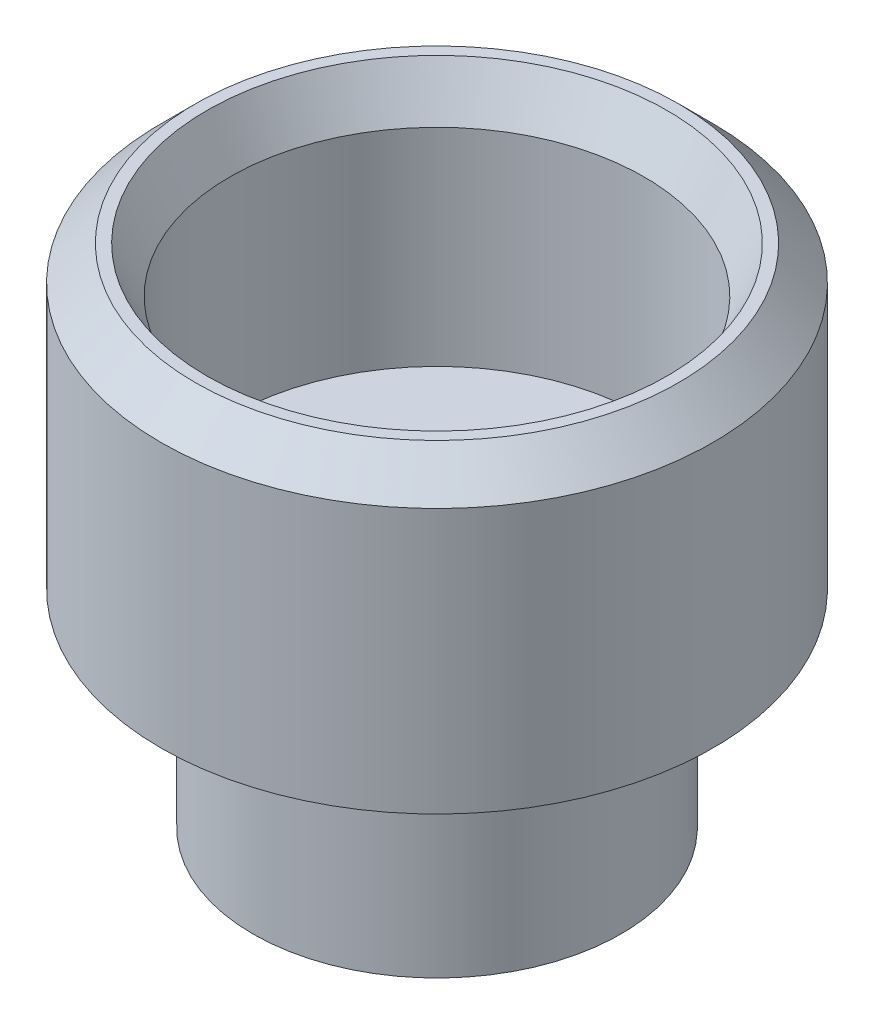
ISO-10303-21;
HEADER;
FILE_DESCRIPTION(('STEP AP214'),'2;1');
FILE_NAME('part.step','',(''),(''),'','','');
FILE_SCHEMA(('AUTOMOTIVE_DESIGN { 1 0 10303 214 1 1 1 1 }'));
ENDSEC;
DATA;
#1=APPLICATION_CONTEXT('core data for automotive mechanical design processes');
#2=APPLICATION_PROTOCOL_DEFINITION('international standard','automotive_design',2000,#1);
#3=PRODUCT_CONTEXT('',#1,'mechanical');
#4=PRODUCT('Part','Part','',(#3));
#5=PRODUCT_RELATED_PRODUCT_CATEGORY('part','',(#4));
#6=PRODUCT_DEFINITION_FORMATION('','',#4);
#7=PRODUCT_DEFINITION_CONTEXT('part definition',#1,'design');
#8=PRODUCT_DEFINITION('design','',#6,#7);
#9=PRODUCT_DEFINITION_SHAPE('','',#8);
#10=(LENGTH_UNIT() NAMED_UNIT(*) SI_UNIT(.MILLI.,.METRE.));
#11=(NAMED_UNIT(*) PLANE_ANGLE_UNIT() SI_UNIT($,.RADIAN.));
#12=(NAMED_UNIT(*) SI_UNIT($,.STERADIAN.) SOLID_ANGLE_UNIT());
#13=UNCERTAINTY_MEASURE_WITH_UNIT(LENGTH_MEASURE(1.E-05),#10,'distance_accuracy_value','');
#14=(GEOMETRIC_REPRESENTATION_CONTEXT(3) GLOBAL_UNCERTAINTY_ASSIGNED_CONTEXT((#13)) GLOBAL_UNIT_ASSIGNED_CONTEXT((#10,
#11,#12)) REPRESENTATION_CONTEXT('',''));
#15=CARTESIAN_POINT('',(0.,0.,0.));
#16=DIRECTION('',(0.,0.,1.));
#17=DIRECTION('',(1.,0.,0.));
#18=AXIS2_PLACEMENT_3D('',#15,#16,#17);
#19=CARTESIAN_POINT('',(0.,9.,0.));
#20=DIRECTION('',(0.,-1.,0.));
#21=DIRECTION('',(0.,0.,-1.));
#22=AXIS2_PLACEMENT_3D('',#19,#20,#21);
#23=CYLINDRICAL_SURFACE('',#22,8.);
#24=CARTESIAN_POINT('',(0.,6.5,0.));
#25=DIRECTION('',(0.,1.,0.));
#26=DIRECTION('',(0.,0.,1.));
#27=AXIS2_PLACEMENT_3D('',#24,#25,#26);
#28=CIRCLE('',#27,8.);
#29=CARTESIAN_POINT('',(0.,6.5,8.));
#30=VERTEX_POINT('',#29);
#31=EDGE_CURVE('E55',#30,#30,#28,.F.);
#32=ORIENTED_EDGE('',*,*,#31,.T.);
#33=EDGE_LOOP('',(#32));
#34=FACE_BOUND('',#33,.T.);
#35=CARTESIAN_POINT('',(0.,0.,0.));
#36=DIRECTION('',(0.,1.,0.));
#37=DIRECTION('',(0.,0.,1.));
#38=AXIS2_PLACEMENT_3D('',#35,#36,#37);
#39=CIRCLE('',#38,8.);
#40=CARTESIAN_POINT('',(0.,0.,8.));
#41=VERTEX_POINT('',#40);
#42=EDGE_CURVE('E58',#41,#41,#39,.T.);
#43=ORIENTED_EDGE('',*,*,#42,.T.);
#44=EDGE_LOOP('',(#43));
#45=FACE_BOUND('',#44,.T.);
#46=ADVANCED_FACE('F35',(#34,#45),#23,.T.);
#47=CARTESIAN_POINT('',(0.,0.,0.));
#48=DIRECTION('',(0.,1.,0.));
#49=DIRECTION('',(0.,0.,1.));
#50=AXIS2_PLACEMENT_3D('',#47,#48,#49);
#51=PLANE('',#50);
#52=CARTESIAN_POINT('',(0.,0.,0.));
#53=DIRECTION('',(0.,-1.,0.));
#54=DIRECTION('',(0.,0.,-1.));
#55=AXIS2_PLACEMENT_3D('',#52,#53,#54);
#56=CIRCLE('',#55,3.5);
#57=CARTESIAN_POINT('',(0.,0.,-3.5));
#58=VERTEX_POINT('',#57);
#59=EDGE_CURVE('E64',#58,#58,#56,.T.);
#60=ORIENTED_EDGE('',*,*,#59,.F.);
#61=EDGE_LOOP('',(#60));
#62=FACE_BOUND('',#61,.T.);
#63=ORIENTED_EDGE('',*,*,#42,.F.);
#64=EDGE_LOOP('',(#63));
#65=FACE_BOUND('',#64,.T.);
#66=ADVANCED_FACE('F89',(#62,#65),#51,.F.);
#67=CARTESIAN_POINT('',(0.,22.,0.));
#68=DIRECTION('',(0.,-1.,0.));
#69=DIRECTION('',(0.,0.,-1.));
#70=AXIS2_PLACEMENT_3D('',#67,#68,#69);
#71=CYLINDRICAL_SURFACE('',#70,12.);
#72=CARTESIAN_POINT('',(0.,20.5,0.));
#73=DIRECTION('',(0.,1.,0.));
#74=DIRECTION('',(0.,0.,1.));
#75=AXIS2_PLACEMENT_3D('',#72,#73,#74);
#76=CIRCLE('',#75,12.);
#77=CARTESIAN_POINT('',(0.,20.5,-12.));
#78=VERTEX_POINT('',#77);
#79=EDGE_CURVE('E46',#78,#78,#76,.F.);
#80=CARTESIAN_POINT('',(0.,9.,0.));
#81=DIRECTION('',(0.,1.,0.));
#82=DIRECTION('',(0.,0.,1.));
#83=AXIS2_PLACEMENT_3D('',#80,#81,#82);
#84=CIRCLE('',#83,12.);
#85=CARTESIAN_POINT('',(0.,9.,-12.));
#86=VERTEX_POINT('',#85);
#87=EDGE_CURVE('E61',#86,#86,#84,.T.);
#88=CARTESIAN_POINT('',(0.,20.5,-12.));
#89=CARTESIAN_POINT('',(0.,20.3802083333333,-12.));
#90=CARTESIAN_POINT('',(0.,20.2604166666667,-12.));
#91=CARTESIAN_POINT('',(0.,20.0208333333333,-12.));
#92=CARTESIAN_POINT('',(0.,19.9010416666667,-12.));
#93=CARTESIAN_POINT('',(0.,19.6614583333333,-12.));
#94=CARTESIAN_POINT('',(0.,19.5416666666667,-12.));
#95=CARTESIAN_POINT('',(0.,19.3020833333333,-12.));
#96=CARTESIAN_POINT('',(0.,19.1822916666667,-12.));
#97=CARTESIAN_POINT('',(0.,18.9427083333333,-12.));
#98=CARTESIAN_POINT('',(0.,18.8229166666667,-12.));
#99=CARTESIAN_POINT('',(0.,18.5833333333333,-12.));
#100=CARTESIAN_POINT('',(0.,18.4635416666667,-12.));
#101=CARTESIAN_POINT('',(0.,18.2239583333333,-12.));
#102=CARTESIAN_POINT('',(0.,18.1041666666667,-12.));
#103=CARTESIAN_POINT('',(0.,17.8645833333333,-12.));
#104=CARTESIAN_POINT('',(0.,17.7447916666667,-12.));
#105=CARTESIAN_POINT('',(0.,17.5052083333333,-12.));
#106=CARTESIAN_POINT('',(0.,17.3854166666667,-12.));
#107=CARTESIAN_POINT('',(0.,17.1458333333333,-12.));
#108=CARTESIAN_POINT('',(0.,17.0260416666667,-12.));
#109=CARTESIAN_POINT('',(0.,16.7864583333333,-12.));
#110=CARTESIAN_POINT('',(0.,16.6666666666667,-12.));
#111=CARTESIAN_POINT('',(0.,16.4270833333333,-12.));
#112=CARTESIAN_POINT('',(0.,16.3072916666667,-12.));
#113=CARTESIAN_POINT('',(0.,16.0677083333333,-12.));
#114=CARTESIAN_POINT('',(0.,15.9479166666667,-12.));
#115=CARTESIAN_POINT('',(0.,15.7083333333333,-12.));
#116=CARTESIAN_POINT('',(0.,15.5885416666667,-12.));
#117=CARTESIAN_POINT('',(0.,15.3489583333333,-12.));
#118=CARTESIAN_POINT('',(0.,15.2291666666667,-12.));
#119=CARTESIAN_POINT('',(0.,14.9895833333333,-12.));
#120=CARTESIAN_POINT('',(0.,14.8697916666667,-12.));
#121=CARTESIAN_POINT('',(0.,14.6302083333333,-12.));
#122=CARTESIAN_POINT('',(0.,14.5104166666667,-12.));
#123=CARTESIAN_POINT('',(0.,14.2708333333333,-12.));
#124=CARTESIAN_POINT('',(0.,14.1510416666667,-12.));
#125=CARTESIAN_POINT('',(0.,13.9114583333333,-12.));
#126=CARTESIAN_POINT('',(0.,13.7916666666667,-12.));
#127=CARTESIAN_POINT('',(0.,13.5520833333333,-12.));
#128=CARTESIAN_POINT('',(0.,13.4322916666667,-12.));
#129=CARTESIAN_POINT('',(0.,13.1927083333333,-12.));
#130=CARTESIAN_POINT('',(0.,13.0729166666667,-12.));
#131=CARTESIAN_POINT('',(0.,12.8333333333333,-12.));
#132=CARTESIAN_POINT('',(0.,12.7135416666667,-12.));
#133=CARTESIAN_POINT('',(0.,12.4739583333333,-12.));
#134=CARTESIAN_POINT('',(0.,12.3541666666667,-12.));
#135=CARTESIAN_POINT('',(0.,12.1145833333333,-12.));
#136=CARTESIAN_POINT('',(0.,11.9947916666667,-12.));
#137=CARTESIAN_POINT('',(0.,11.7552083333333,-12.));
#138=CARTESIAN_POINT('',(0.,11.6354166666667,-12.));
#139=CARTESIAN_POINT('',(0.,11.3958333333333,-12.));
#140=CARTESIAN_POINT('',(0.,11.2760416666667,-12.));
#141=CARTESIAN_POINT('',(0.,11.0364583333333,-12.));
#142=CARTESIAN_POINT('',(0.,10.9166666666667,-12.));
#143=CARTESIAN_POINT('',(0.,10.6770833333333,-12.));
#144=CARTESIAN_POINT('',(0.,10.5572916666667,-12.));
#145=CARTESIAN_POINT('',(0.,10.3177083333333,-12.));
#146=CARTESIAN_POINT('',(0.,10.1979166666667,-12.));
#147=CARTESIAN_POINT('',(0.,9.95833333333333,-12.));
#148=CARTESIAN_POINT('',(0.,9.83854166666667,-12.));
#149=CARTESIAN_POINT('',(0.,9.59895833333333,-12.));
#150=CARTESIAN_POINT('',(0.,9.47916666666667,-12.));
#151=CARTESIAN_POINT('',(0.,9.23958333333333,-12.));
#152=CARTESIAN_POINT('',(0.,9.11979166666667,-12.));
#153=CARTESIAN_POINT('',(0.,9.,-12.));
#154=B_SPLINE_CURVE_WITH_KNOTS('',3,(#88,#89,#90,#91,#92,#93,#94,#95,#96,#97,#98,#99,#100,#101,
#102,#103,#104,#105,#106,#107,#108,#109,#110,#111,#112,#113,#114,#115,#116,#117,#118,#119,#120,
#121,#122,#123,#124,#125,#126,#127,#128,#129,#130,#131,#132,#133,#134,#135,#136,#137,#138,#139,
#140,#141,#142,#143,#144,#145,#146,#147,#148,#149,#150,#151,#152,#153),.UNSPECIFIED.,.F.,.F.,(4,
2,2,2,2,2,2,2,2,2,2,2,2,2,2,2,2,2,2,2,2,2,2,2,2,2,2,2,2,2,2,2,4),(0.,0.359375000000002,
0.718750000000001,1.078125,1.4375,1.796875,2.15625,2.515625,2.875,3.234375,3.59375,
3.95312500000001,4.3125,4.671875,5.03125,5.390625,5.75000000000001,6.10937500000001,6.46875,
6.82812500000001,7.1875,7.54687500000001,7.90625000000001,8.26562500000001,8.62500000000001,
8.98437500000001,9.34375000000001,9.70312500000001,10.0625,10.421875,10.78125,11.140625,11.5),.UNSPECIFIED.);
#155=EDGE_CURVE('BSEAM95',#78,#86,#154,.T.);
#156=ORIENTED_EDGE('',*,*,#79,.T.);
#157=ORIENTED_EDGE('',*,*,#87,.T.);
#158=ORIENTED_EDGE('',*,*,#155,.T.);
#159=ORIENTED_EDGE('',*,*,#155,.F.);
#160=EDGE_LOOP('',(#156,#158,#157,#159));
#161=FACE_BOUND('',#160,.T.);
#162=ADVANCED_FACE('F95',(#161),#71,.T.);
#163=CARTESIAN_POINT('',(0.,22.,0.));
#164=DIRECTION('',(0.,1.,0.));
#165=DIRECTION('',(0.,0.,1.));
#166=AXIS2_PLACEMENT_3D('',#163,#164,#165);
#167=PLANE('',#166);
#168=CARTESIAN_POINT('',(0.,22.,0.));
#169=DIRECTION('',(0.,1.,0.));
#170=DIRECTION('',(0.,0.,1.));
#171=AXIS2_PLACEMENT_3D('',#168,#169,#170);
#172=CIRCLE('',#171,9.99999999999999);
#173=CARTESIAN_POINT('',(0.,22.,9.99999999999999));
#174=VERTEX_POINT('',#173);
#175=EDGE_CURVE('E10',#174,#174,#172,.F.);
#176=ORIENTED_EDGE('',*,*,#175,.T.);
#177=EDGE_LOOP('',(#176));
#178=FACE_BOUND('',#177,.T.);
#179=CARTESIAN_POINT('',(0.,22.,0.));
#180=DIRECTION('',(0.,1.,0.));
#181=DIRECTION('',(0.,0.,1.));
#182=AXIS2_PLACEMENT_3D('',#179,#180,#181);
#183=CIRCLE('',#182,10.5);
#184=CARTESIAN_POINT('',(0.,22.,10.5));
#185=VERTEX_POINT('',#184);
#186=EDGE_CURVE('E50',#185,#185,#183,.T.);
#187=ORIENTED_EDGE('',*,*,#186,.T.);
#188=EDGE_LOOP('',(#187));
#189=FACE_BOUND('',#188,.T.);
#190=ADVANCED_FACE('F104',(#178,#189),#167,.T.);
#191=CARTESIAN_POINT('',(0.,9.,0.));
#192=DIRECTION('',(0.,1.,0.));
#193=DIRECTION('',(0.,0.,1.));
#194=AXIS2_PLACEMENT_3D('',#191,#192,#193);
#195=CONICAL_SURFACE('',#194,12.,1.01219701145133);
#196=ORIENTED_EDGE('',*,*,#31,.F.);
#197=EDGE_LOOP('',(#196));
#198=FACE_BOUND('',#197,.T.);
#199=ORIENTED_EDGE('',*,*,#87,.F.);
#200=EDGE_LOOP('',(#199));
#201=FACE_BOUND('',#200,.T.);
#202=ADVANCED_FACE('F101',(#198,#201),#195,.T.);
#203=CARTESIAN_POINT('',(0.,22.,0.));
#204=DIRECTION('',(0.,-1.,0.));
#205=DIRECTION('',(0.,0.,-1.));
#206=AXIS2_PLACEMENT_3D('',#203,#204,#205);
#207=CONICAL_SURFACE('',#206,10.5,0.785398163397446);
#208=ORIENTED_EDGE('',*,*,#79,.F.);
#209=EDGE_LOOP('',(#208));
#210=FACE_BOUND('',#209,.T.);
#211=ORIENTED_EDGE('',*,*,#186,.F.);
#212=EDGE_LOOP('',(#211));
#213=FACE_BOUND('',#212,.T.);
#214=ADVANCED_FACE('F103',(#210,#213),#207,.T.);
#215=CARTESIAN_POINT('',(0.,11.,0.));
#216=DIRECTION('',(0.,-1.,0.));
#217=DIRECTION('',(0.,0.,-1.));
#218=AXIS2_PLACEMENT_3D('',#215,#216,#217);
#219=CYLINDRICAL_SURFACE('',#218,3.5);
#220=CARTESIAN_POINT('',(0.,11.,0.));
#221=DIRECTION('',(0.,1.,0.));
#222=DIRECTION('',(0.,0.,1.));
#223=AXIS2_PLACEMENT_3D('',#220,#221,#222);
#224=CIRCLE('',#223,3.5);
#225=CARTESIAN_POINT('',(0.,11.,3.5));
#226=VERTEX_POINT('',#225);
#227=EDGE_CURVE('E67',#226,#226,#224,.F.);
#228=ORIENTED_EDGE('',*,*,#227,.F.);
#229=EDGE_LOOP('',(#228));
#230=FACE_BOUND('',#229,.T.);
#231=ORIENTED_EDGE('',*,*,#59,.T.);
#232=EDGE_LOOP('',(#231));
#233=FACE_BOUND('',#232,.T.);
#234=ADVANCED_FACE('F85',(#230,#233),#219,.F.);
#235=CARTESIAN_POINT('',(0.,11.,0.));
#236=DIRECTION('',(0.,1.,0.));
#237=DIRECTION('',(0.,0.,1.));
#238=AXIS2_PLACEMENT_3D('',#235,#236,#237);
#239=PLANE('',#238);
#240=CARTESIAN_POINT('',(0.,11.,0.));
#241=DIRECTION('',(0.,1.,0.));
#242=DIRECTION('',(0.,0.,1.));
#243=AXIS2_PLACEMENT_3D('',#240,#241,#242);
#244=CIRCLE('',#243,9.);
#245=CARTESIAN_POINT('',(0.,11.,9.));
#246=VERTEX_POINT('',#245);
#247=EDGE_CURVE('E70',#246,#246,#244,.T.);
#248=ORIENTED_EDGE('',*,*,#247,.T.);
#249=EDGE_LOOP('',(#248));
#250=FACE_BOUND('',#249,.T.);
#251=ORIENTED_EDGE('',*,*,#227,.T.);
#252=EDGE_LOOP('',(#251));
#253=FACE_BOUND('',#252,.T.);
#254=ADVANCED_FACE('F74',(#250,#253),#239,.T.);
#255=CARTESIAN_POINT('',(0.,11.,0.));
#256=DIRECTION('',(0.,1.,0.));
#257=DIRECTION('',(0.,0.,1.));
#258=AXIS2_PLACEMENT_3D('',#255,#256,#257);
#259=CYLINDRICAL_SURFACE('',#258,9.);
#260=CARTESIAN_POINT('',(0.,20.,0.));
#261=DIRECTION('',(0.,1.,0.));
#262=DIRECTION('',(0.,0.,1.));
#263=AXIS2_PLACEMENT_3D('',#260,#261,#262);
#264=CIRCLE('',#263,9.);
#265=CARTESIAN_POINT('',(0.,20.,9.));
#266=VERTEX_POINT('',#265);
#267=EDGE_CURVE('E42',#266,#266,#264,.T.);
#268=ORIENTED_EDGE('',*,*,#267,.T.);
#269=EDGE_LOOP('',(#268));
#270=FACE_BOUND('',#269,.T.);
#271=ORIENTED_EDGE('',*,*,#247,.F.);
#272=EDGE_LOOP('',(#271));
#273=FACE_BOUND('',#272,.T.);
#274=ADVANCED_FACE('F77',(#270,#273),#259,.F.);
#275=CARTESIAN_POINT('',(0.,20.,0.));
#276=DIRECTION('',(0.,1.,0.));
#277=DIRECTION('',(0.,0.,1.));
#278=AXIS2_PLACEMENT_3D('',#275,#276,#277);
#279=CONICAL_SURFACE('',#278,9.,0.463647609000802);
#280=ORIENTED_EDGE('',*,*,#175,.F.);
#281=EDGE_LOOP('',(#280));
#282=FACE_BOUND('',#281,.T.);
#283=ORIENTED_EDGE('',*,*,#267,.F.);
#284=EDGE_LOOP('',(#283));
#285=FACE_BOUND('',#284,.T.);
#286=ADVANCED_FACE('F37',(#282,#285),#279,.F.);
#287=CLOSED_SHELL('',(#46,#66,#162,#190,#202,#214,#234,#254,#274,#286));
#288=MANIFOLD_SOLID_BREP('B2',#287);
#289=ADVANCED_BREP_SHAPE_REPRESENTATION('',(#18,#288),#14);
#290=SHAPE_DEFINITION_REPRESENTATION(#9,#289);
ENDSEC;
END-ISO-10303-21;
